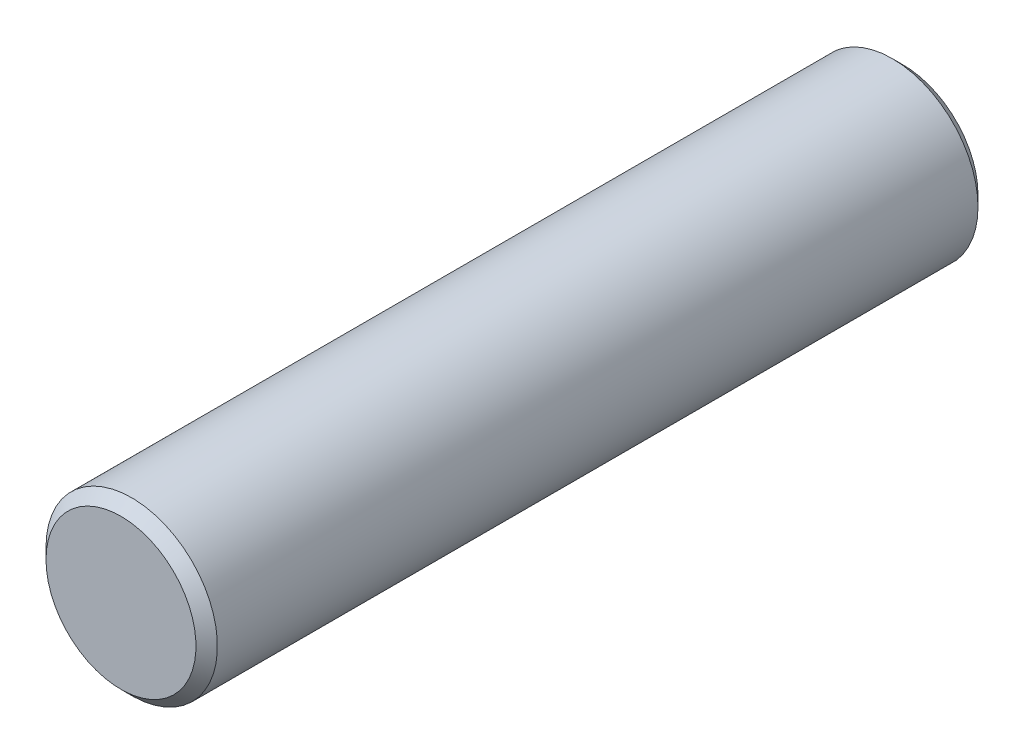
ISO-10303-21;
HEADER;
FILE_DESCRIPTION(('STEP AP214'),'2;1');
FILE_NAME('part.step','',(''),(''),'','','');
FILE_SCHEMA(('AUTOMOTIVE_DESIGN { 1 0 10303 214 1 1 1 1 }'));
ENDSEC;
DATA;
#1=APPLICATION_CONTEXT('core data for automotive mechanical design processes');
#2=APPLICATION_PROTOCOL_DEFINITION('international standard','automotive_design',2000,#1);
#3=PRODUCT_CONTEXT('',#1,'mechanical');
#4=PRODUCT('Part','Part','',(#3));
#5=PRODUCT_RELATED_PRODUCT_CATEGORY('part','',(#4));
#6=PRODUCT_DEFINITION_FORMATION('','',#4);
#7=PRODUCT_DEFINITION_CONTEXT('part definition',#1,'design');
#8=PRODUCT_DEFINITION('design','',#6,#7);
#9=PRODUCT_DEFINITION_SHAPE('','',#8);
#10=(LENGTH_UNIT() NAMED_UNIT(*) SI_UNIT(.MILLI.,.METRE.));
#11=(NAMED_UNIT(*) PLANE_ANGLE_UNIT() SI_UNIT($,.RADIAN.));
#12=(NAMED_UNIT(*) SI_UNIT($,.STERADIAN.) SOLID_ANGLE_UNIT());
#13=UNCERTAINTY_MEASURE_WITH_UNIT(LENGTH_MEASURE(1.E-05),#10,'distance_accuracy_value','');
#14=(GEOMETRIC_REPRESENTATION_CONTEXT(3) GLOBAL_UNCERTAINTY_ASSIGNED_CONTEXT((#13)) GLOBAL_UNIT_ASSIGNED_CONTEXT((#10,
#11,#12)) REPRESENTATION_CONTEXT('',''));
#15=CARTESIAN_POINT('',(0.,0.,0.));
#16=DIRECTION('',(0.,0.,1.));
#17=DIRECTION('',(1.,0.,0.));
#18=AXIS2_PLACEMENT_3D('',#15,#16,#17);
#19=CARTESIAN_POINT('',(6.461667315,-19.698303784,-2.6));
#20=DIRECTION('',(0.,0.,-1.));
#21=DIRECTION('',(-1.,0.,0.));
#22=AXIS2_PLACEMENT_3D('',#19,#20,#21);
#23=PLANE('',#22);
#24=CARTESIAN_POINT('',(5.753267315,-18.989903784,-2.60000000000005));
#25=DIRECTION('',(0.,0.,1.));
#26=DIRECTION('',(1.,0.,0.));
#27=AXIS2_PLACEMENT_3D('',#24,#25,#26);
#28=CIRCLE('',#27,0.699999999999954);
#29=CARTESIAN_POINT('',(6.45326731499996,-18.989903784,-2.60000000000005));
#30=VERTEX_POINT('',#29);
#31=EDGE_CURVE('E19',#30,#30,#28,.F.);
#32=ORIENTED_EDGE('',*,*,#31,.T.);
#33=EDGE_LOOP('',(#32));
#34=FACE_BOUND('',#33,.T.);
#35=ADVANCED_FACE('F15',(#34),#23,.T.);
#36=CARTESIAN_POINT('',(5.753267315,-18.989903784,-2.6));
#37=DIRECTION('',(0.,0.,1.));
#38=DIRECTION('',(1.,0.,0.));
#39=AXIS2_PLACEMENT_3D('',#36,#37,#38);
#40=CONICAL_SURFACE('',#39,0.7,0.785398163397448);
#41=CARTESIAN_POINT('',(5.753267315,-18.989903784,-2.5));
#42=DIRECTION('',(0.,0.,-1.));
#43=DIRECTION('',(-1.,0.,0.));
#44=AXIS2_PLACEMENT_3D('',#41,#42,#43);
#45=CIRCLE('',#44,0.799999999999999);
#46=CARTESIAN_POINT('',(4.953267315,-18.989903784,-2.5));
#47=VERTEX_POINT('',#46);
#48=EDGE_CURVE('E27',#47,#47,#45,.T.);
#49=ORIENTED_EDGE('',*,*,#48,.T.);
#50=EDGE_LOOP('',(#49));
#51=FACE_BOUND('',#50,.T.);
#52=ORIENTED_EDGE('',*,*,#31,.F.);
#53=EDGE_LOOP('',(#52));
#54=FACE_BOUND('',#53,.T.);
#55=ADVANCED_FACE('F37',(#51,#54),#40,.T.);
#56=CARTESIAN_POINT('',(5.753267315,-18.989903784,4.6));
#57=DIRECTION('',(0.,0.,-1.));
#58=DIRECTION('',(-1.,0.,0.));
#59=AXIS2_PLACEMENT_3D('',#56,#57,#58);
#60=CYLINDRICAL_SURFACE('',#59,0.799999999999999);
#61=ORIENTED_EDGE('',*,*,#48,.F.);
#62=EDGE_LOOP('',(#61));
#63=FACE_BOUND('',#62,.T.);
#64=CARTESIAN_POINT('',(5.753267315,-18.989903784,4.59999999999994));
#65=DIRECTION('',(0.,0.,-1.));
#66=DIRECTION('',(-1.,0.,0.));
#67=AXIS2_PLACEMENT_3D('',#64,#65,#66);
#68=CIRCLE('',#67,0.799999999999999);
#69=CARTESIAN_POINT('',(4.953267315,-18.989903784,4.6));
#70=VERTEX_POINT('',#69);
#71=EDGE_CURVE('E23',#70,#70,#68,.T.);
#72=ORIENTED_EDGE('',*,*,#71,.T.);
#73=EDGE_LOOP('',(#72));
#74=FACE_BOUND('',#73,.T.);
#75=ADVANCED_FACE('F39',(#63,#74),#60,.T.);
#76=CARTESIAN_POINT('',(4.992433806,-19.641665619,4.7));
#77=DIRECTION('',(0.,0.,1.));
#78=DIRECTION('',(0.997032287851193,-0.0769845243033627,0.));
#79=AXIS2_PLACEMENT_3D('',#76,#77,#78);
#80=PLANE('',#79);
#81=CARTESIAN_POINT('',(5.753267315,-18.989903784,4.69999999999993));
#82=DIRECTION('',(0.,0.,-1.));
#83=DIRECTION('',(-1.,0.,0.));
#84=AXIS2_PLACEMENT_3D('',#81,#82,#83);
#85=CIRCLE('',#84,0.700000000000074);
#86=CARTESIAN_POINT('',(5.05326731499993,-18.989903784,4.69999999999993));
#87=VERTEX_POINT('',#86);
#88=EDGE_CURVE('E10',#87,#87,#85,.F.);
#89=ORIENTED_EDGE('',*,*,#88,.T.);
#90=EDGE_LOOP('',(#89));
#91=FACE_BOUND('',#90,.T.);
#92=ADVANCED_FACE('F17',(#91),#80,.T.);
#93=CARTESIAN_POINT('',(5.753267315,-18.989903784,4.7));
#94=DIRECTION('',(0.,0.,-1.));
#95=DIRECTION('',(-1.,0.,0.));
#96=AXIS2_PLACEMENT_3D('',#93,#94,#95);
#97=CONICAL_SURFACE('',#96,0.7,0.785398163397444);
#98=ORIENTED_EDGE('',*,*,#88,.F.);
#99=EDGE_LOOP('',(#98));
#100=FACE_BOUND('',#99,.T.);
#101=ORIENTED_EDGE('',*,*,#71,.F.);
#102=EDGE_LOOP('',(#101));
#103=FACE_BOUND('',#102,.T.);
#104=ADVANCED_FACE('F49',(#100,#103),#97,.T.);
#105=CLOSED_SHELL('',(#35,#55,#75,#92,#104));
#106=MANIFOLD_SOLID_BREP('B1',#105);
#107=ADVANCED_BREP_SHAPE_REPRESENTATION('',(#18,#106),#14);
#108=SHAPE_DEFINITION_REPRESENTATION(#9,#107);
ENDSEC;
END-ISO-10303-21;
